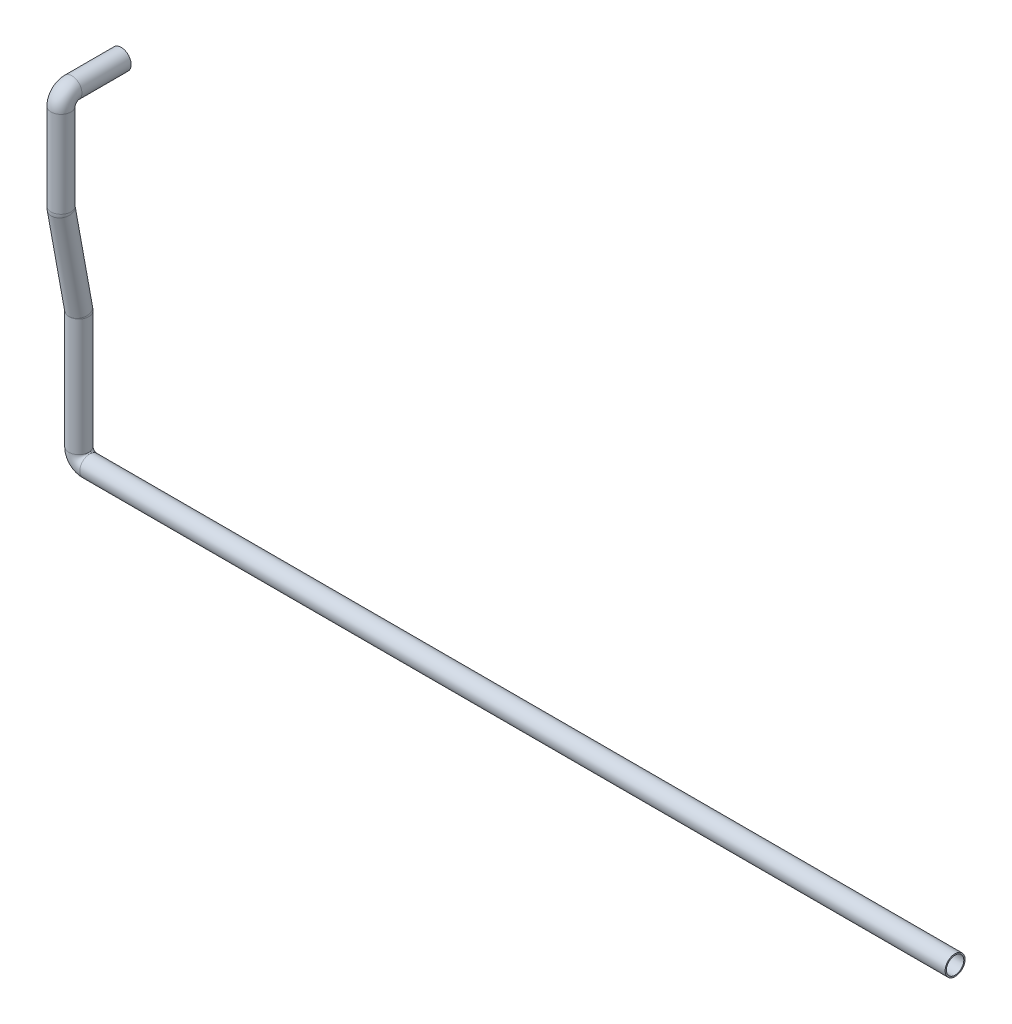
ISO-10303-21;
HEADER;
FILE_DESCRIPTION(('STEP AP214'),'2;1');
FILE_NAME('part.step','',(''),(''),'','','');
FILE_SCHEMA(('AUTOMOTIVE_DESIGN { 1 0 10303 214 1 1 1 1 }'));
ENDSEC;
DATA;
#1=APPLICATION_CONTEXT('core data for automotive mechanical design processes');
#2=APPLICATION_PROTOCOL_DEFINITION('international standard','automotive_design',2000,#1);
#3=PRODUCT_CONTEXT('',#1,'mechanical');
#4=PRODUCT('Part','Part','',(#3));
#5=PRODUCT_RELATED_PRODUCT_CATEGORY('part','',(#4));
#6=PRODUCT_DEFINITION_FORMATION('','',#4);
#7=PRODUCT_DEFINITION_CONTEXT('part definition',#1,'design');
#8=PRODUCT_DEFINITION('design','',#6,#7);
#9=PRODUCT_DEFINITION_SHAPE('','',#8);
#10=(LENGTH_UNIT() NAMED_UNIT(*) SI_UNIT(.MILLI.,.METRE.));
#11=(NAMED_UNIT(*) PLANE_ANGLE_UNIT() SI_UNIT($,.RADIAN.));
#12=(NAMED_UNIT(*) SI_UNIT($,.STERADIAN.) SOLID_ANGLE_UNIT());
#13=UNCERTAINTY_MEASURE_WITH_UNIT(LENGTH_MEASURE(1.E-05),#10,'distance_accuracy_value','');
#14=(GEOMETRIC_REPRESENTATION_CONTEXT(3) GLOBAL_UNCERTAINTY_ASSIGNED_CONTEXT((#13)) GLOBAL_UNIT_ASSIGNED_CONTEXT((#10,
#11,#12)) REPRESENTATION_CONTEXT('',''));
#15=CARTESIAN_POINT('',(0.,0.,0.));
#16=DIRECTION('',(0.,0.,1.));
#17=DIRECTION('',(1.,0.,0.));
#18=AXIS2_PLACEMENT_3D('',#15,#16,#17);
#19=CARTESIAN_POINT('',(40.,-1190.,155.));
#20=DIRECTION('',(1.,0.,0.));
#21=DIRECTION('',(0.,0.,-1.));
#22=AXIS2_PLACEMENT_3D('',#19,#20,#21);
#23=CYLINDRICAL_SURFACE('',#22,36.5);
#24=CARTESIAN_POINT('',(40.,-1190.,155.));
#25=DIRECTION('',(1.,0.,0.));
#26=DIRECTION('',(0.,1.,0.));
#27=AXIS2_PLACEMENT_3D('',#24,#25,#26);
#28=CIRCLE('',#27,36.5);
#29=CARTESIAN_POINT('',(40.0000000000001,-1226.5,155.));
#30=VERTEX_POINT('',#29);
#31=EDGE_CURVE('E38',#30,#30,#28,.T.);
#32=ORIENTED_EDGE('',*,*,#31,.T.);
#33=EDGE_LOOP('',(#32));
#34=FACE_BOUND('',#33,.T.);
#35=CARTESIAN_POINT('',(3204.,-1190.,155.000000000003));
#36=DIRECTION('',(1.,0.,0.));
#37=DIRECTION('',(0.,1.,0.));
#38=AXIS2_PLACEMENT_3D('',#35,#36,#37);
#39=CIRCLE('',#38,36.5);
#40=CARTESIAN_POINT('',(3204.,-1153.5,155.000000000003));
#41=VERTEX_POINT('',#40);
#42=EDGE_CURVE('E10',#41,#41,#39,.T.);
#43=ORIENTED_EDGE('',*,*,#42,.F.);
#44=EDGE_LOOP('',(#43));
#45=FACE_BOUND('',#44,.T.);
#46=ADVANCED_FACE('F28',(#34,#45),#23,.T.);
#47=CARTESIAN_POINT('',(40.,-1190.,155.));
#48=DIRECTION('',(1.,0.,0.));
#49=DIRECTION('',(0.,0.,-1.));
#50=AXIS2_PLACEMENT_3D('',#47,#48,#49);
#51=CYLINDRICAL_SURFACE('',#50,31.75);
#52=CARTESIAN_POINT('',(40.,-1190.,155.));
#53=DIRECTION('',(1.,0.,0.));
#54=DIRECTION('',(0.,1.,0.));
#55=AXIS2_PLACEMENT_3D('',#52,#53,#54);
#56=CIRCLE('',#55,31.75);
#57=CARTESIAN_POINT('',(40.0000000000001,-1221.75,155.));
#58=VERTEX_POINT('',#57);
#59=EDGE_CURVE('E42',#58,#58,#56,.T.);
#60=ORIENTED_EDGE('',*,*,#59,.F.);
#61=EDGE_LOOP('',(#60));
#62=FACE_BOUND('',#61,.T.);
#63=CARTESIAN_POINT('',(3204.,-1190.,155.000000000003));
#64=DIRECTION('',(1.,0.,0.));
#65=DIRECTION('',(0.,1.,0.));
#66=AXIS2_PLACEMENT_3D('',#63,#64,#65);
#67=CIRCLE('',#66,31.75);
#68=CARTESIAN_POINT('',(3204.,-1158.25,155.000000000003));
#69=VERTEX_POINT('',#68);
#70=EDGE_CURVE('E34',#69,#69,#67,.T.);
#71=ORIENTED_EDGE('',*,*,#70,.T.);
#72=EDGE_LOOP('',(#71));
#73=FACE_BOUND('',#72,.T.);
#74=ADVANCED_FACE('F148',(#62,#73),#51,.F.);
#75=CARTESIAN_POINT('',(39.9999999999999,-1150.,155.));
#76=DIRECTION('',(0.,0.,1.));
#77=DIRECTION('',(1.,0.,0.));
#78=AXIS2_PLACEMENT_3D('',#75,#76,#77);
#79=TOROIDAL_SURFACE('',#78,40.0000000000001,36.5);
#80=CARTESIAN_POINT('',(-1.43527980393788E-13,-1150.,155.));
#81=DIRECTION('',(0.,-1.,0.));
#82=DIRECTION('',(1.,0.,0.));
#83=AXIS2_PLACEMENT_3D('',#80,#81,#82);
#84=CIRCLE('',#83,36.5);
#85=CARTESIAN_POINT('',(-36.5000000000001,-1150.,155.));
#86=VERTEX_POINT('',#85);
#87=EDGE_CURVE('E47',#86,#86,#84,.T.);
#88=CARTESIAN_POINT('',(39.9999999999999,-1150.,155.));
#89=DIRECTION('',(0.,0.,1.));
#90=DIRECTION('',(1.,0.,0.));
#91=AXIS2_PLACEMENT_3D('',#88,#89,#90);
#92=CIRCLE('',#91,76.5000000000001);
#93=EDGE_CURVE('',#86,#30,#92,.T.);
#94=ORIENTED_EDGE('',*,*,#87,.T.);
#95=ORIENTED_EDGE('',*,*,#31,.F.);
#96=ORIENTED_EDGE('',*,*,#93,.T.);
#97=ORIENTED_EDGE('',*,*,#93,.F.);
#98=EDGE_LOOP('',(#94,#96,#95,#97));
#99=FACE_BOUND('',#98,.T.);
#100=ADVANCED_FACE('F144',(#99),#79,.T.);
#101=CARTESIAN_POINT('',(39.9999999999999,-1150.,155.));
#102=DIRECTION('',(0.,0.,1.));
#103=DIRECTION('',(1.,0.,0.));
#104=AXIS2_PLACEMENT_3D('',#101,#102,#103);
#105=TOROIDAL_SURFACE('',#104,40.0000000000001,31.75);
#106=CARTESIAN_POINT('',(-1.43527980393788E-13,-1150.,155.));
#107=DIRECTION('',(0.,-1.,0.));
#108=DIRECTION('',(1.,0.,0.));
#109=AXIS2_PLACEMENT_3D('',#106,#107,#108);
#110=CIRCLE('',#109,31.75);
#111=CARTESIAN_POINT('',(-31.7500000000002,-1150.,155.));
#112=VERTEX_POINT('',#111);
#113=EDGE_CURVE('E50',#112,#112,#110,.T.);
#114=CARTESIAN_POINT('',(39.9999999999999,-1150.,155.));
#115=DIRECTION('',(0.,0.,1.));
#116=DIRECTION('',(1.,0.,0.));
#117=AXIS2_PLACEMENT_3D('',#114,#115,#116);
#118=CIRCLE('',#117,71.7500000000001);
#119=EDGE_CURVE('',#112,#58,#118,.T.);
#120=ORIENTED_EDGE('',*,*,#113,.F.);
#121=ORIENTED_EDGE('',*,*,#59,.T.);
#122=ORIENTED_EDGE('',*,*,#119,.T.);
#123=ORIENTED_EDGE('',*,*,#119,.F.);
#124=EDGE_LOOP('',(#120,#122,#121,#123));
#125=FACE_BOUND('',#124,.T.);
#126=ADVANCED_FACE('F141',(#125),#105,.F.);
#127=CARTESIAN_POINT('',(0.,-720.611767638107,155.));
#128=DIRECTION('',(0.,-1.,0.));
#129=DIRECTION('',(1.,0.,0.));
#130=AXIS2_PLACEMENT_3D('',#127,#128,#129);
#131=CYLINDRICAL_SURFACE('',#130,36.5);
#132=CARTESIAN_POINT('',(0.,-720.611767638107,155.));
#133=DIRECTION('',(0.,-1.,0.));
#134=DIRECTION('',(1.,0.,0.));
#135=AXIS2_PLACEMENT_3D('',#132,#133,#134);
#136=CIRCLE('',#135,36.5);
#137=CARTESIAN_POINT('',(0.,-720.611767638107,118.5));
#138=VERTEX_POINT('',#137);
#139=EDGE_CURVE('E53',#138,#138,#136,.T.);
#140=ORIENTED_EDGE('',*,*,#139,.T.);
#141=EDGE_LOOP('',(#140));
#142=FACE_BOUND('',#141,.T.);
#143=ORIENTED_EDGE('',*,*,#87,.F.);
#144=EDGE_LOOP('',(#143));
#145=FACE_BOUND('',#144,.T.);
#146=ADVANCED_FACE('F137',(#142,#145),#131,.T.);
#147=CARTESIAN_POINT('',(0.,-720.611767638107,155.));
#148=DIRECTION('',(0.,-1.,0.));
#149=DIRECTION('',(1.,0.,0.));
#150=AXIS2_PLACEMENT_3D('',#147,#148,#149);
#151=CYLINDRICAL_SURFACE('',#150,31.75);
#152=CARTESIAN_POINT('',(0.,-720.611767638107,155.));
#153=DIRECTION('',(0.,-1.,0.));
#154=DIRECTION('',(1.,0.,0.));
#155=AXIS2_PLACEMENT_3D('',#152,#153,#154);
#156=CIRCLE('',#155,31.75);
#157=CARTESIAN_POINT('',(0.,-720.611767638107,123.25));
#158=VERTEX_POINT('',#157);
#159=EDGE_CURVE('E56',#158,#158,#156,.T.);
#160=ORIENTED_EDGE('',*,*,#159,.F.);
#161=EDGE_LOOP('',(#160));
#162=FACE_BOUND('',#161,.T.);
#163=ORIENTED_EDGE('',*,*,#113,.T.);
#164=EDGE_LOOP('',(#163));
#165=FACE_BOUND('',#164,.T.);
#166=ADVANCED_FACE('F134',(#162,#165),#151,.F.);
#167=CARTESIAN_POINT('',(0.,-720.611767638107,195.));
#168=DIRECTION('',(-1.,0.,0.));
#169=DIRECTION('',(0.,0.,1.));
#170=AXIS2_PLACEMENT_3D('',#167,#168,#169);
#171=TOROIDAL_SURFACE('',#170,40.0000000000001,36.5);
#172=CARTESIAN_POINT('',(0.,-713.44664986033,155.646968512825));
#173=DIRECTION('',(0.,-0.983825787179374,-0.179127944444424));
#174=DIRECTION('',(1.,0.,0.));
#175=AXIS2_PLACEMENT_3D('',#172,#173,#174);
#176=CIRCLE('',#175,36.5);
#177=CARTESIAN_POINT('',(0.,-706.908479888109,119.737327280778));
#178=VERTEX_POINT('',#177);
#179=EDGE_CURVE('E59',#178,#178,#176,.T.);
#180=CARTESIAN_POINT('',(0.,-720.611767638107,195.));
#181=DIRECTION('',(-1.,0.,0.));
#182=DIRECTION('',(0.,0.,1.));
#183=AXIS2_PLACEMENT_3D('',#180,#181,#182);
#184=CIRCLE('',#183,76.5000000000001);
#185=EDGE_CURVE('',#178,#138,#184,.T.);
#186=ORIENTED_EDGE('',*,*,#179,.T.);
#187=ORIENTED_EDGE('',*,*,#139,.F.);
#188=ORIENTED_EDGE('',*,*,#185,.T.);
#189=ORIENTED_EDGE('',*,*,#185,.F.);
#190=EDGE_LOOP('',(#186,#188,#187,#189));
#191=FACE_BOUND('',#190,.T.);
#192=ADVANCED_FACE('F130',(#191),#171,.T.);
#193=CARTESIAN_POINT('',(0.,-720.611767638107,195.));
#194=DIRECTION('',(-1.,0.,0.));
#195=DIRECTION('',(0.,0.,1.));
#196=AXIS2_PLACEMENT_3D('',#193,#194,#195);
#197=TOROIDAL_SURFACE('',#196,40.0000000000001,31.75);
#198=CARTESIAN_POINT('',(0.,-713.44664986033,155.646968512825));
#199=DIRECTION('',(0.,-0.983825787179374,-0.179127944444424));
#200=DIRECTION('',(1.,0.,0.));
#201=AXIS2_PLACEMENT_3D('',#198,#199,#200);
#202=CIRCLE('',#201,31.75);
#203=CARTESIAN_POINT('',(0.,-707.75933762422,124.41049976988));
#204=VERTEX_POINT('',#203);
#205=EDGE_CURVE('E62',#204,#204,#202,.T.);
#206=CARTESIAN_POINT('',(0.,-720.611767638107,195.));
#207=DIRECTION('',(-1.,0.,0.));
#208=DIRECTION('',(0.,0.,1.));
#209=AXIS2_PLACEMENT_3D('',#206,#207,#208);
#210=CIRCLE('',#209,71.7500000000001);
#211=EDGE_CURVE('',#204,#158,#210,.T.);
#212=ORIENTED_EDGE('',*,*,#205,.F.);
#213=ORIENTED_EDGE('',*,*,#159,.T.);
#214=ORIENTED_EDGE('',*,*,#211,.T.);
#215=ORIENTED_EDGE('',*,*,#211,.F.);
#216=EDGE_LOOP('',(#212,#214,#213,#215));
#217=FACE_BOUND('',#216,.T.);
#218=ADVANCED_FACE('F127',(#217),#197,.F.);
#219=CARTESIAN_POINT('',(0.,-363.55335013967,219.353031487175));
#220=DIRECTION('',(0.,-0.983825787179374,-0.179127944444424));
#221=DIRECTION('',(0.,0.179127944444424,-0.983825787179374));
#222=AXIS2_PLACEMENT_3D('',#219,#220,#221);
#223=CYLINDRICAL_SURFACE('',#222,36.5);
#224=CARTESIAN_POINT('',(0.,-363.55335013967,219.353031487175));
#225=DIRECTION('',(0.,-0.983825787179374,-0.179127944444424));
#226=DIRECTION('',(1.,0.,0.));
#227=AXIS2_PLACEMENT_3D('',#224,#225,#226);
#228=CIRCLE('',#227,36.5);
#229=CARTESIAN_POINT('',(0.,-370.091520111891,255.262672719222));
#230=VERTEX_POINT('',#229);
#231=EDGE_CURVE('E65',#230,#230,#228,.T.);
#232=ORIENTED_EDGE('',*,*,#231,.T.);
#233=EDGE_LOOP('',(#232));
#234=FACE_BOUND('',#233,.T.);
#235=ORIENTED_EDGE('',*,*,#179,.F.);
#236=EDGE_LOOP('',(#235));
#237=FACE_BOUND('',#236,.T.);
#238=ADVANCED_FACE('F123',(#234,#237),#223,.T.);
#239=CARTESIAN_POINT('',(0.,-363.55335013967,219.353031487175));
#240=DIRECTION('',(0.,-0.983825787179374,-0.179127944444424));
#241=DIRECTION('',(0.,0.179127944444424,-0.983825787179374));
#242=AXIS2_PLACEMENT_3D('',#239,#240,#241);
#243=CYLINDRICAL_SURFACE('',#242,31.75);
#244=CARTESIAN_POINT('',(0.,-363.55335013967,219.353031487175));
#245=DIRECTION('',(0.,-0.983825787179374,-0.179127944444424));
#246=DIRECTION('',(1.,0.,0.));
#247=AXIS2_PLACEMENT_3D('',#244,#245,#246);
#248=CIRCLE('',#247,31.75);
#249=CARTESIAN_POINT('',(0.,-369.24066237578,250.58950023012));
#250=VERTEX_POINT('',#249);
#251=EDGE_CURVE('E68',#250,#250,#248,.T.);
#252=ORIENTED_EDGE('',*,*,#251,.F.);
#253=EDGE_LOOP('',(#252));
#254=FACE_BOUND('',#253,.T.);
#255=ORIENTED_EDGE('',*,*,#205,.T.);
#256=EDGE_LOOP('',(#255));
#257=FACE_BOUND('',#256,.T.);
#258=ADVANCED_FACE('F120',(#254,#257),#243,.F.);
#259=CARTESIAN_POINT('',(0.,-356.388232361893,180.));
#260=DIRECTION('',(1.,0.,0.));
#261=DIRECTION('',(0.,0.,-1.));
#262=AXIS2_PLACEMENT_3D('',#259,#260,#261);
#263=TOROIDAL_SURFACE('',#262,40.,36.5);
#264=CARTESIAN_POINT('',(0.,-356.388232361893,220.));
#265=DIRECTION('',(0.,-1.,0.));
#266=DIRECTION('',(1.,0.,0.));
#267=AXIS2_PLACEMENT_3D('',#264,#265,#266);
#268=CIRCLE('',#267,36.5);
#269=CARTESIAN_POINT('',(0.,-356.388232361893,256.5));
#270=VERTEX_POINT('',#269);
#271=EDGE_CURVE('E71',#270,#270,#268,.T.);
#272=CARTESIAN_POINT('',(0.,-356.388232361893,180.));
#273=DIRECTION('',(1.,0.,0.));
#274=DIRECTION('',(0.,0.,-1.));
#275=AXIS2_PLACEMENT_3D('',#272,#273,#274);
#276=CIRCLE('',#275,76.5);
#277=EDGE_CURVE('',#270,#230,#276,.T.);
#278=ORIENTED_EDGE('',*,*,#271,.T.);
#279=ORIENTED_EDGE('',*,*,#231,.F.);
#280=ORIENTED_EDGE('',*,*,#277,.T.);
#281=ORIENTED_EDGE('',*,*,#277,.F.);
#282=EDGE_LOOP('',(#278,#280,#279,#281));
#283=FACE_BOUND('',#282,.T.);
#284=ADVANCED_FACE('F116',(#283),#263,.T.);
#285=CARTESIAN_POINT('',(0.,-356.388232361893,180.));
#286=DIRECTION('',(1.,0.,0.));
#287=DIRECTION('',(0.,0.,-1.));
#288=AXIS2_PLACEMENT_3D('',#285,#286,#287);
#289=TOROIDAL_SURFACE('',#288,40.,31.75);
#290=CARTESIAN_POINT('',(0.,-356.388232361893,220.));
#291=DIRECTION('',(0.,-1.,0.));
#292=DIRECTION('',(1.,0.,0.));
#293=AXIS2_PLACEMENT_3D('',#290,#291,#292);
#294=CIRCLE('',#293,31.75);
#295=CARTESIAN_POINT('',(0.,-356.388232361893,251.75));
#296=VERTEX_POINT('',#295);
#297=EDGE_CURVE('E74',#296,#296,#294,.T.);
#298=CARTESIAN_POINT('',(0.,-356.388232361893,180.));
#299=DIRECTION('',(1.,0.,0.));
#300=DIRECTION('',(0.,0.,-1.));
#301=AXIS2_PLACEMENT_3D('',#298,#299,#300);
#302=CIRCLE('',#301,71.75);
#303=EDGE_CURVE('',#296,#250,#302,.T.);
#304=ORIENTED_EDGE('',*,*,#297,.F.);
#305=ORIENTED_EDGE('',*,*,#251,.T.);
#306=ORIENTED_EDGE('',*,*,#303,.T.);
#307=ORIENTED_EDGE('',*,*,#303,.F.);
#308=EDGE_LOOP('',(#304,#306,#305,#307));
#309=FACE_BOUND('',#308,.T.);
#310=ADVANCED_FACE('F113',(#309),#289,.F.);
#311=CARTESIAN_POINT('',(0.,-40.,220.));
#312=DIRECTION('',(0.,-1.,0.));
#313=DIRECTION('',(1.,0.,0.));
#314=AXIS2_PLACEMENT_3D('',#311,#312,#313);
#315=CYLINDRICAL_SURFACE('',#314,36.5);
#316=CARTESIAN_POINT('',(0.,-40.,220.));
#317=DIRECTION('',(0.,-1.,0.));
#318=DIRECTION('',(1.,0.,0.));
#319=AXIS2_PLACEMENT_3D('',#316,#317,#318);
#320=CIRCLE('',#319,36.5);
#321=CARTESIAN_POINT('',(0.,-40.,256.5));
#322=VERTEX_POINT('',#321);
#323=EDGE_CURVE('E77',#322,#322,#320,.T.);
#324=ORIENTED_EDGE('',*,*,#323,.T.);
#325=EDGE_LOOP('',(#324));
#326=FACE_BOUND('',#325,.T.);
#327=ORIENTED_EDGE('',*,*,#271,.F.);
#328=EDGE_LOOP('',(#327));
#329=FACE_BOUND('',#328,.T.);
#330=ADVANCED_FACE('F109',(#326,#329),#315,.T.);
#331=CARTESIAN_POINT('',(0.,-40.,220.));
#332=DIRECTION('',(0.,-1.,0.));
#333=DIRECTION('',(1.,0.,0.));
#334=AXIS2_PLACEMENT_3D('',#331,#332,#333);
#335=CYLINDRICAL_SURFACE('',#334,31.75);
#336=CARTESIAN_POINT('',(0.,-40.,220.));
#337=DIRECTION('',(0.,-1.,0.));
#338=DIRECTION('',(1.,0.,0.));
#339=AXIS2_PLACEMENT_3D('',#336,#337,#338);
#340=CIRCLE('',#339,31.75);
#341=CARTESIAN_POINT('',(0.,-40.,251.75));
#342=VERTEX_POINT('',#341);
#343=EDGE_CURVE('E80',#342,#342,#340,.T.);
#344=ORIENTED_EDGE('',*,*,#343,.F.);
#345=EDGE_LOOP('',(#344));
#346=FACE_BOUND('',#345,.T.);
#347=ORIENTED_EDGE('',*,*,#297,.T.);
#348=EDGE_LOOP('',(#347));
#349=FACE_BOUND('',#348,.T.);
#350=ADVANCED_FACE('F106',(#346,#349),#335,.F.);
#351=CARTESIAN_POINT('',(0.,-40.,180.));
#352=DIRECTION('',(1.,0.,0.));
#353=DIRECTION('',(0.,1.,0.));
#354=AXIS2_PLACEMENT_3D('',#351,#352,#353);
#355=TOROIDAL_SURFACE('',#354,40.,36.5);
#356=CARTESIAN_POINT('',(0.,0.,180.));
#357=DIRECTION('',(0.,0.,1.));
#358=DIRECTION('',(1.,0.,0.));
#359=AXIS2_PLACEMENT_3D('',#356,#357,#358);
#360=CIRCLE('',#359,36.5);
#361=CARTESIAN_POINT('',(0.,36.5,180.));
#362=VERTEX_POINT('',#361);
#363=EDGE_CURVE('E83',#362,#362,#360,.T.);
#364=CARTESIAN_POINT('',(0.,-40.,180.));
#365=DIRECTION('',(1.,0.,0.));
#366=DIRECTION('',(0.,1.,0.));
#367=AXIS2_PLACEMENT_3D('',#364,#365,#366);
#368=CIRCLE('',#367,76.5);
#369=EDGE_CURVE('',#362,#322,#368,.T.);
#370=ORIENTED_EDGE('',*,*,#363,.T.);
#371=ORIENTED_EDGE('',*,*,#323,.F.);
#372=ORIENTED_EDGE('',*,*,#369,.T.);
#373=ORIENTED_EDGE('',*,*,#369,.F.);
#374=EDGE_LOOP('',(#370,#372,#371,#373));
#375=FACE_BOUND('',#374,.T.);
#376=ADVANCED_FACE('F102',(#375),#355,.T.);
#377=CARTESIAN_POINT('',(0.,-40.,180.));
#378=DIRECTION('',(1.,0.,0.));
#379=DIRECTION('',(0.,1.,0.));
#380=AXIS2_PLACEMENT_3D('',#377,#378,#379);
#381=TOROIDAL_SURFACE('',#380,40.,31.75);
#382=CARTESIAN_POINT('',(0.,0.,180.));
#383=DIRECTION('',(0.,0.,1.));
#384=DIRECTION('',(1.,0.,0.));
#385=AXIS2_PLACEMENT_3D('',#382,#383,#384);
#386=CIRCLE('',#385,31.75);
#387=CARTESIAN_POINT('',(0.,31.75,180.));
#388=VERTEX_POINT('',#387);
#389=EDGE_CURVE('E87',#388,#388,#386,.T.);
#390=CARTESIAN_POINT('',(0.,-40.,180.));
#391=DIRECTION('',(1.,0.,0.));
#392=DIRECTION('',(0.,1.,0.));
#393=AXIS2_PLACEMENT_3D('',#390,#391,#392);
#394=CIRCLE('',#393,71.75);
#395=EDGE_CURVE('',#388,#342,#394,.T.);
#396=ORIENTED_EDGE('',*,*,#389,.F.);
#397=ORIENTED_EDGE('',*,*,#343,.T.);
#398=ORIENTED_EDGE('',*,*,#395,.T.);
#399=ORIENTED_EDGE('',*,*,#395,.F.);
#400=EDGE_LOOP('',(#396,#398,#397,#399));
#401=FACE_BOUND('',#400,.T.);
#402=ADVANCED_FACE('F99',(#401),#381,.F.);
#403=CARTESIAN_POINT('',(0.,0.,180.));
#404=DIRECTION('',(0.,0.,-1.));
#405=DIRECTION('',(-1.,0.,0.));
#406=AXIS2_PLACEMENT_3D('',#403,#404,#405);
#407=CYLINDRICAL_SURFACE('',#406,31.75);
#408=ORIENTED_EDGE('',*,*,#389,.T.);
#409=EDGE_LOOP('',(#408));
#410=FACE_BOUND('',#409,.T.);
#411=CARTESIAN_POINT('',(0.,0.,0.));
#412=DIRECTION('',(0.,0.,1.));
#413=DIRECTION('',(1.,0.,0.));
#414=AXIS2_PLACEMENT_3D('',#411,#412,#413);
#415=CIRCLE('',#414,31.75);
#416=CARTESIAN_POINT('',(31.75,0.,0.));
#417=VERTEX_POINT('',#416);
#418=EDGE_CURVE('E88',#417,#417,#415,.T.);
#419=ORIENTED_EDGE('',*,*,#418,.F.);
#420=EDGE_LOOP('',(#419));
#421=FACE_BOUND('',#420,.T.);
#422=ADVANCED_FACE('F96',(#410,#421),#407,.F.);
#423=CARTESIAN_POINT('',(0.,0.,180.));
#424=DIRECTION('',(0.,0.,-1.));
#425=DIRECTION('',(-1.,0.,0.));
#426=AXIS2_PLACEMENT_3D('',#423,#424,#425);
#427=CYLINDRICAL_SURFACE('',#426,36.5);
#428=ORIENTED_EDGE('',*,*,#363,.F.);
#429=EDGE_LOOP('',(#428));
#430=FACE_BOUND('',#429,.T.);
#431=CARTESIAN_POINT('',(0.,0.,0.));
#432=DIRECTION('',(0.,0.,1.));
#433=DIRECTION('',(1.,0.,0.));
#434=AXIS2_PLACEMENT_3D('',#431,#432,#433);
#435=CIRCLE('',#434,36.5);
#436=CARTESIAN_POINT('',(36.5,0.,0.));
#437=VERTEX_POINT('',#436);
#438=EDGE_CURVE('E84',#437,#437,#435,.T.);
#439=ORIENTED_EDGE('',*,*,#438,.T.);
#440=EDGE_LOOP('',(#439));
#441=FACE_BOUND('',#440,.T.);
#442=ADVANCED_FACE('F178',(#430,#441),#427,.T.);
#443=CARTESIAN_POINT('',(3204.,-1190.,155.000000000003));
#444=DIRECTION('',(1.,0.,0.));
#445=DIRECTION('',(0.,1.,0.));
#446=AXIS2_PLACEMENT_3D('',#443,#444,#445);
#447=PLANE('',#446);
#448=ORIENTED_EDGE('',*,*,#70,.F.);
#449=EDGE_LOOP('',(#448));
#450=FACE_BOUND('',#449,.T.);
#451=ORIENTED_EDGE('',*,*,#42,.T.);
#452=EDGE_LOOP('',(#451));
#453=FACE_BOUND('',#452,.T.);
#454=ADVANCED_FACE('F181',(#450,#453),#447,.T.);
#455=CARTESIAN_POINT('',(0.,0.,0.));
#456=DIRECTION('',(0.,0.,1.));
#457=DIRECTION('',(1.,0.,0.));
#458=AXIS2_PLACEMENT_3D('',#455,#456,#457);
#459=PLANE('',#458);
#460=ORIENTED_EDGE('',*,*,#418,.T.);
#461=EDGE_LOOP('',(#460));
#462=FACE_BOUND('',#461,.T.);
#463=ORIENTED_EDGE('',*,*,#438,.F.);
#464=EDGE_LOOP('',(#463));
#465=FACE_BOUND('',#464,.T.);
#466=ADVANCED_FACE('F183',(#462,#465),#459,.F.);
#467=CLOSED_SHELL('',(#46,#74,#100,#126,#146,#166,#192,#218,#238,#258,#284,#310,#330,#350,#376,
#402,#422,#442,#454,#466));
#468=MANIFOLD_SOLID_BREP('B2',#467);
#469=ADVANCED_BREP_SHAPE_REPRESENTATION('',(#18,#468),#14);
#470=SHAPE_DEFINITION_REPRESENTATION(#9,#469);
ENDSEC;
END-ISO-10303-21;
